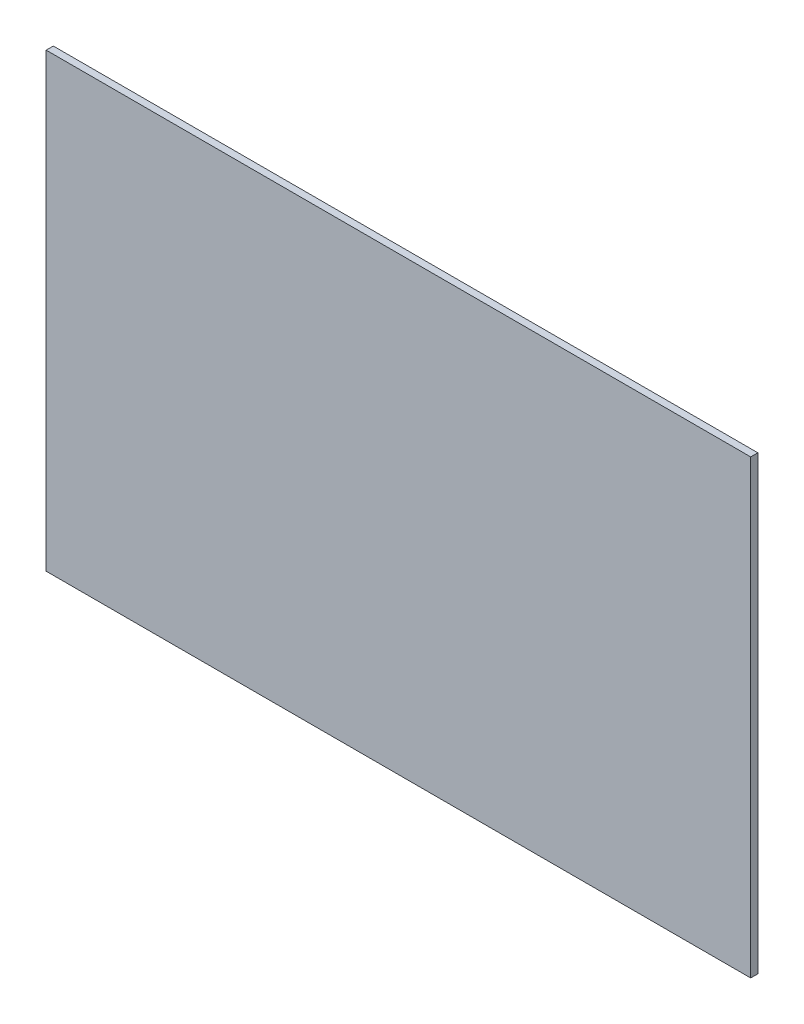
ISO-10303-21;
HEADER;
FILE_DESCRIPTION(('STEP AP214'),'2;1');
FILE_NAME('part.step','',(''),(''),'','','');
FILE_SCHEMA(('AUTOMOTIVE_DESIGN { 1 0 10303 214 1 1 1 1 }'));
ENDSEC;
DATA;
#1=APPLICATION_CONTEXT('core data for automotive mechanical design processes');
#2=APPLICATION_PROTOCOL_DEFINITION('international standard','automotive_design',2000,#1);
#3=PRODUCT_CONTEXT('',#1,'mechanical');
#4=PRODUCT('Part','Part','',(#3));
#5=PRODUCT_RELATED_PRODUCT_CATEGORY('part','',(#4));
#6=PRODUCT_DEFINITION_FORMATION('','',#4);
#7=PRODUCT_DEFINITION_CONTEXT('part definition',#1,'design');
#8=PRODUCT_DEFINITION('design','',#6,#7);
#9=PRODUCT_DEFINITION_SHAPE('','',#8);
#10=(LENGTH_UNIT() NAMED_UNIT(*) SI_UNIT(.MILLI.,.METRE.));
#11=(NAMED_UNIT(*) PLANE_ANGLE_UNIT() SI_UNIT($,.RADIAN.));
#12=(NAMED_UNIT(*) SI_UNIT($,.STERADIAN.) SOLID_ANGLE_UNIT());
#13=UNCERTAINTY_MEASURE_WITH_UNIT(LENGTH_MEASURE(1.E-05),#10,'distance_accuracy_value','');
#14=(GEOMETRIC_REPRESENTATION_CONTEXT(3) GLOBAL_UNCERTAINTY_ASSIGNED_CONTEXT((#13)) GLOBAL_UNIT_ASSIGNED_CONTEXT((#10,
#11,#12)) REPRESENTATION_CONTEXT('',''));
#15=CARTESIAN_POINT('',(0.,0.,0.));
#16=DIRECTION('',(0.,0.,1.));
#17=DIRECTION('',(1.,0.,0.));
#18=AXIS2_PLACEMENT_3D('',#15,#16,#17);
#19=CARTESIAN_POINT('',(-74.0000000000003,98.5,1.5));
#20=DIRECTION('',(1.,0.,0.));
#21=DIRECTION('',(0.,0.,-1.));
#22=AXIS2_PLACEMENT_3D('',#19,#20,#21);
#23=PLANE('',#22);
#24=DIRECTION('',(0.,-1.,0.));
#25=VECTOR('',#24,1.);
#26=CARTESIAN_POINT('',(-74.0000000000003,98.5,0.));
#27=LINE('',#26,#25);
#28=CARTESIAN_POINT('',(-74.0000000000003,98.5,0.));
#29=VERTEX_POINT('',#28);
#30=CARTESIAN_POINT('',(-74.0000000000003,3.70710678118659,0.));
#31=VERTEX_POINT('',#30);
#32=EDGE_CURVE('E112',#29,#31,#27,.T.);
#33=ORIENTED_EDGE('',*,*,#32,.T.);
#34=DIRECTION('',(0.,0.,-1.));
#35=VECTOR('',#34,1.);
#36=CARTESIAN_POINT('',(-74.0000000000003,3.70710678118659,1.5));
#37=LINE('',#36,#35);
#38=CARTESIAN_POINT('',(-74.0000000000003,3.70710678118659,1.5));
#39=VERTEX_POINT('',#38);
#40=EDGE_CURVE('E11',#39,#31,#37,.T.);
#41=ORIENTED_EDGE('',*,*,#40,.F.);
#42=DIRECTION('',(0.,-1.,0.));
#43=VECTOR('',#42,1.);
#44=CARTESIAN_POINT('',(-74.0000000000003,98.5,1.5));
#45=LINE('',#44,#43);
#46=CARTESIAN_POINT('',(-74.0000000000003,98.5,1.5));
#47=VERTEX_POINT('',#46);
#48=EDGE_CURVE('E95',#47,#39,#45,.T.);
#49=ORIENTED_EDGE('',*,*,#48,.F.);
#50=DIRECTION('',(0.,0.,-1.));
#51=VECTOR('',#50,1.);
#52=CARTESIAN_POINT('',(-74.0000000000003,98.5,1.5));
#53=LINE('',#52,#51);
#54=EDGE_CURVE('E108',#47,#29,#53,.T.);
#55=ORIENTED_EDGE('',*,*,#54,.T.);
#56=EDGE_LOOP('',(#33,#41,#49,#55));
#57=FACE_BOUND('',#56,.T.);
#58=ADVANCED_FACE('F43',(#57),#23,.F.);
#59=CARTESIAN_POINT('',(-74.0000000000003,3.70710678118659,1.5));
#60=DIRECTION('',(0.,1.,0.));
#61=DIRECTION('',(0.,0.,1.));
#62=AXIS2_PLACEMENT_3D('',#59,#60,#61);
#63=PLANE('',#62);
#64=DIRECTION('',(1.,0.,0.));
#65=VECTOR('',#64,1.);
#66=CARTESIAN_POINT('',(-74.0000000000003,3.70710678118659,0.));
#67=LINE('',#66,#65);
#68=CARTESIAN_POINT('',(74.0000000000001,3.70710678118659,0.));
#69=VERTEX_POINT('',#68);
#70=EDGE_CURVE('E100',#31,#69,#67,.T.);
#71=ORIENTED_EDGE('',*,*,#70,.T.);
#72=DIRECTION('',(0.,0.,-1.));
#73=VECTOR('',#72,1.);
#74=CARTESIAN_POINT('',(74.0000000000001,3.70710678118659,1.5));
#75=LINE('',#74,#73);
#76=CARTESIAN_POINT('',(74.0000000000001,3.70710678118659,1.5));
#77=VERTEX_POINT('',#76);
#78=EDGE_CURVE('E52',#77,#69,#75,.T.);
#79=ORIENTED_EDGE('',*,*,#78,.F.);
#80=DIRECTION('',(1.,0.,0.));
#81=VECTOR('',#80,1.);
#82=CARTESIAN_POINT('',(-74.0000000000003,3.70710678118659,1.5));
#83=LINE('',#82,#81);
#84=EDGE_CURVE('E90',#39,#77,#83,.T.);
#85=ORIENTED_EDGE('',*,*,#84,.F.);
#86=ORIENTED_EDGE('',*,*,#40,.T.);
#87=EDGE_LOOP('',(#71,#79,#85,#86));
#88=FACE_BOUND('',#87,.T.);
#89=ADVANCED_FACE('F99',(#88),#63,.F.);
#90=CARTESIAN_POINT('',(74.0000000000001,98.5,1.5));
#91=DIRECTION('',(-1.,0.,0.));
#92=DIRECTION('',(0.,0.,1.));
#93=AXIS2_PLACEMENT_3D('',#90,#91,#92);
#94=PLANE('',#93);
#95=DIRECTION('',(0.,1.,0.));
#96=VECTOR('',#95,1.);
#97=CARTESIAN_POINT('',(74.0000000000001,98.5,0.));
#98=LINE('',#97,#96);
#99=CARTESIAN_POINT('',(74.0000000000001,98.5,0.));
#100=VERTEX_POINT('',#99);
#101=EDGE_CURVE('E77',#69,#100,#98,.T.);
#102=ORIENTED_EDGE('',*,*,#101,.T.);
#103=DIRECTION('',(0.,0.,-1.));
#104=VECTOR('',#103,1.);
#105=CARTESIAN_POINT('',(74.0000000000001,98.5,1.5));
#106=LINE('',#105,#104);
#107=CARTESIAN_POINT('',(74.0000000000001,98.5,1.5));
#108=VERTEX_POINT('',#107);
#109=EDGE_CURVE('E102',#108,#100,#106,.T.);
#110=ORIENTED_EDGE('',*,*,#109,.F.);
#111=DIRECTION('',(0.,1.,0.));
#112=VECTOR('',#111,1.);
#113=CARTESIAN_POINT('',(74.0000000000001,98.5,1.5));
#114=LINE('',#113,#112);
#115=EDGE_CURVE('E93',#77,#108,#114,.T.);
#116=ORIENTED_EDGE('',*,*,#115,.F.);
#117=ORIENTED_EDGE('',*,*,#78,.T.);
#118=EDGE_LOOP('',(#102,#110,#116,#117));
#119=FACE_BOUND('',#118,.T.);
#120=ADVANCED_FACE('F103',(#119),#94,.F.);
#121=CARTESIAN_POINT('',(-74.0000000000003,98.5,1.5));
#122=DIRECTION('',(0.,-1.,0.));
#123=DIRECTION('',(0.,0.,-1.));
#124=AXIS2_PLACEMENT_3D('',#121,#122,#123);
#125=PLANE('',#124);
#126=DIRECTION('',(-1.,0.,0.));
#127=VECTOR('',#126,1.);
#128=CARTESIAN_POINT('',(-74.0000000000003,98.5,0.));
#129=LINE('',#128,#127);
#130=EDGE_CURVE('E83',#100,#29,#129,.T.);
#131=ORIENTED_EDGE('',*,*,#130,.T.);
#132=ORIENTED_EDGE('',*,*,#54,.F.);
#133=DIRECTION('',(-1.,0.,0.));
#134=VECTOR('',#133,1.);
#135=CARTESIAN_POINT('',(-74.0000000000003,98.5,1.5));
#136=LINE('',#135,#134);
#137=EDGE_CURVE('E60',#108,#47,#136,.T.);
#138=ORIENTED_EDGE('',*,*,#137,.F.);
#139=ORIENTED_EDGE('',*,*,#109,.T.);
#140=EDGE_LOOP('',(#131,#132,#138,#139));
#141=FACE_BOUND('',#140,.T.);
#142=ADVANCED_FACE('F126',(#141),#125,.F.);
#143=CARTESIAN_POINT('',(0.,0.,1.5));
#144=DIRECTION('',(0.,0.,1.));
#145=DIRECTION('',(1.,0.,0.));
#146=AXIS2_PLACEMENT_3D('',#143,#144,#145);
#147=PLANE('',#146);
#148=ORIENTED_EDGE('',*,*,#48,.T.);
#149=ORIENTED_EDGE('',*,*,#84,.T.);
#150=ORIENTED_EDGE('',*,*,#115,.T.);
#151=ORIENTED_EDGE('',*,*,#137,.T.);
#152=EDGE_LOOP('',(#148,#149,#150,#151));
#153=FACE_BOUND('',#152,.T.);
#154=ADVANCED_FACE('F91',(#153),#147,.T.);
#155=CARTESIAN_POINT('',(0.,0.,0.));
#156=DIRECTION('',(0.,0.,1.));
#157=DIRECTION('',(1.,0.,0.));
#158=AXIS2_PLACEMENT_3D('',#155,#156,#157);
#159=PLANE('',#158);
#160=ORIENTED_EDGE('',*,*,#32,.F.);
#161=ORIENTED_EDGE('',*,*,#130,.F.);
#162=ORIENTED_EDGE('',*,*,#101,.F.);
#163=ORIENTED_EDGE('',*,*,#70,.F.);
#164=EDGE_LOOP('',(#160,#161,#162,#163));
#165=FACE_BOUND('',#164,.T.);
#166=ADVANCED_FACE('F129',(#165),#159,.F.);
#167=CLOSED_SHELL('',(#58,#89,#120,#142,#154,#166));
#168=MANIFOLD_SOLID_BREP('B2',#167);
#169=ADVANCED_BREP_SHAPE_REPRESENTATION('',(#18,#168),#14);
#170=SHAPE_DEFINITION_REPRESENTATION(#9,#169);
ENDSEC;
END-ISO-10303-21;
